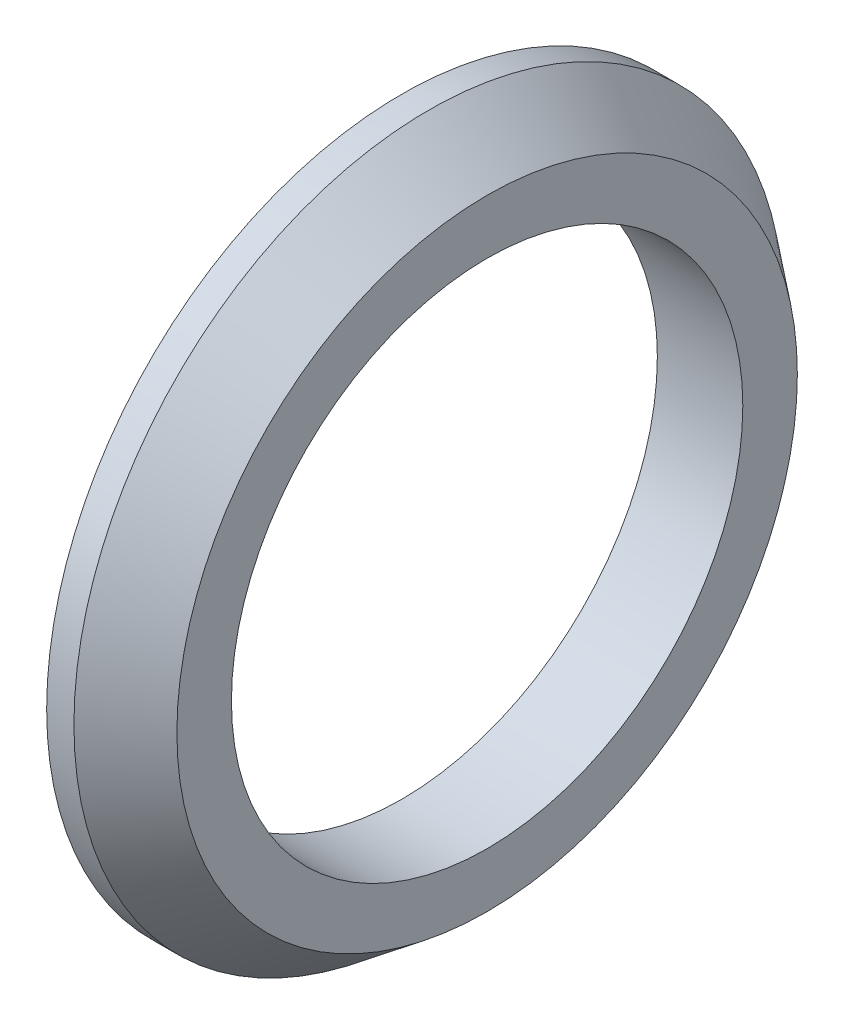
from build123d import *


with BuildPart() as part:
    # Sketch1 → Revolve1 (revolve)
    with BuildSketch(Plane.XY, mode=Mode.PRIVATE) as revolve1_sk:
        Polygon((0, 14.2875), (4.7752, 14.2875), (4.7752, 17.3355), (1.524, 19.8374), (0, 19.8374), align=None)
    revolve(revolve1_sk.sketch.rotate(Axis((0, 0, 0), (1, 0, 0)), 90), axis=Axis((0, 0, 0), (1, 0, 0)))


solid = part.part
